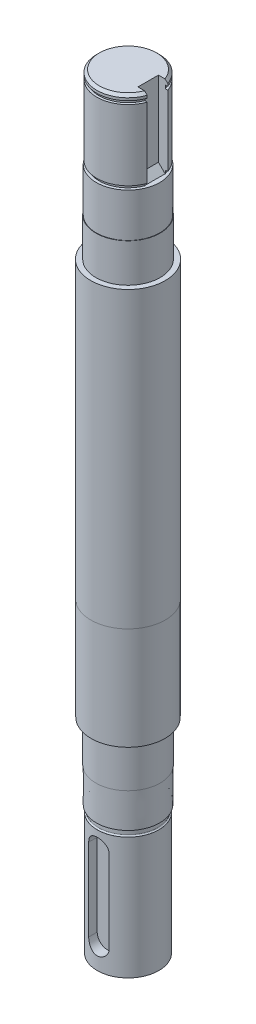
from build123d import *

# Parameters (mm, degrees)
CHAMFER_2_SIZE      = 1
CUT_EXTRUDE_1_DEPTH = 4
SKETCH_8_W          = 8
SKETCH_8_H          = 32
CUT_EXTRUDE_3_DEPTH = 4.3
CHAMFER_3_SIZE      = 2.6


with BuildPart() as part:
    # Sketch 1 → Revolve 2 (revolve)
    with BuildSketch(Plane.XY, mode=Mode.PRIVATE) as revolve_2_sk:
        Polygon((0, 0), (12, 0), (12, 50), (12.35, 50), (12.342707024, 63.5), (12.5, 63.5), (12.5, 79.5), (14.4, 79.5), (14.4, 119.5), (14.5, 119.5), (14.5, 234), (12.5, 234), (12.5, 249), (12.35, 249), (12.35, 266), (11.257292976, 266), (11.257292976, 267.3), (12.15, 267.3), (12.15, 294.7), (11.25, 294.7), (11.25, 296), (12.15, 296), (12.15, 298), (0, 298), align=None)
    revolve(revolve_2_sk.sketch.rotate(Axis((0, 326.056951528, 0), (0, 1, 0)), 90), axis=Axis((0, 326.056951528, 0), (0, 1, 0)))

    # Chamfer 2
    chamfer_2_edges = [part.edges().sort_by_distance(p)[0] for p in [
        (0, 298, 12.15),
    ]]
    chamfer(chamfer_2_edges, length=CHAMFER_2_SIZE)

    # Sketch 5 → Cut-Revolve 1 (revolve, cut)
    with BuildSketch(Plane.XY, mode=Mode.PRIVATE) as cut_revolve_1_sk:
        with BuildLine():
            Line((12, 50), (12, 47.5))
            Line((12, 47.5), (11.99, 47.5))
            ThreePointArc((11.99, 47.5), (11.643517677, 47.643517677), (11.5, 47.99))
            Line((11.5, 47.99), (11.5, 49.51))
            ThreePointArc((11.5, 49.51), (11.643517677, 49.856482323), (11.99, 50))
            Line((11.99, 50), (12, 50))
        make_face()
    revolve(cut_revolve_1_sk.sketch.rotate(Axis((0, 0, 0), (0, 1, 0)), 90), axis=Axis((0, 0, 0), (0, 1, 0)), mode=Mode.SUBTRACT)

    # Sketch 6 → Cut-Extrude 1 (cut)
    with BuildSketch(Plane.XY.offset(12)):
        with BuildLine():
            Line((-4, 9), (-4, 41))
            ThreePointArc((-4, 41), (0, 45), (4, 41))
            Line((4, 41), (4, 9))
            ThreePointArc((4, 9), (0, 5), (-4, 9))
        make_face()
    extrude(amount=-CUT_EXTRUDE_1_DEPTH, mode=Mode.SUBTRACT)

    # Sketch 8 → Cut-Extrude 3 (cut)
    with BuildSketch(Plane(origin=(12.15, 0, 0), x_dir=(0, 0, -1), z_dir=(1, 0, 0))):
        with Locations((0, 282)):
            Rectangle(SKETCH_8_W, SKETCH_8_H)
    extrude(amount=-CUT_EXTRUDE_3_DEPTH, mode=Mode.SUBTRACT)

    # Chamfer 3
    chamfer_3_edges = [part.edges().sort_by_distance(p)[0] for p in [
        (7.85, 266, 0),
    ]]
    chamfer(chamfer_3_edges, length=CHAMFER_3_SIZE)


solid = part.part
